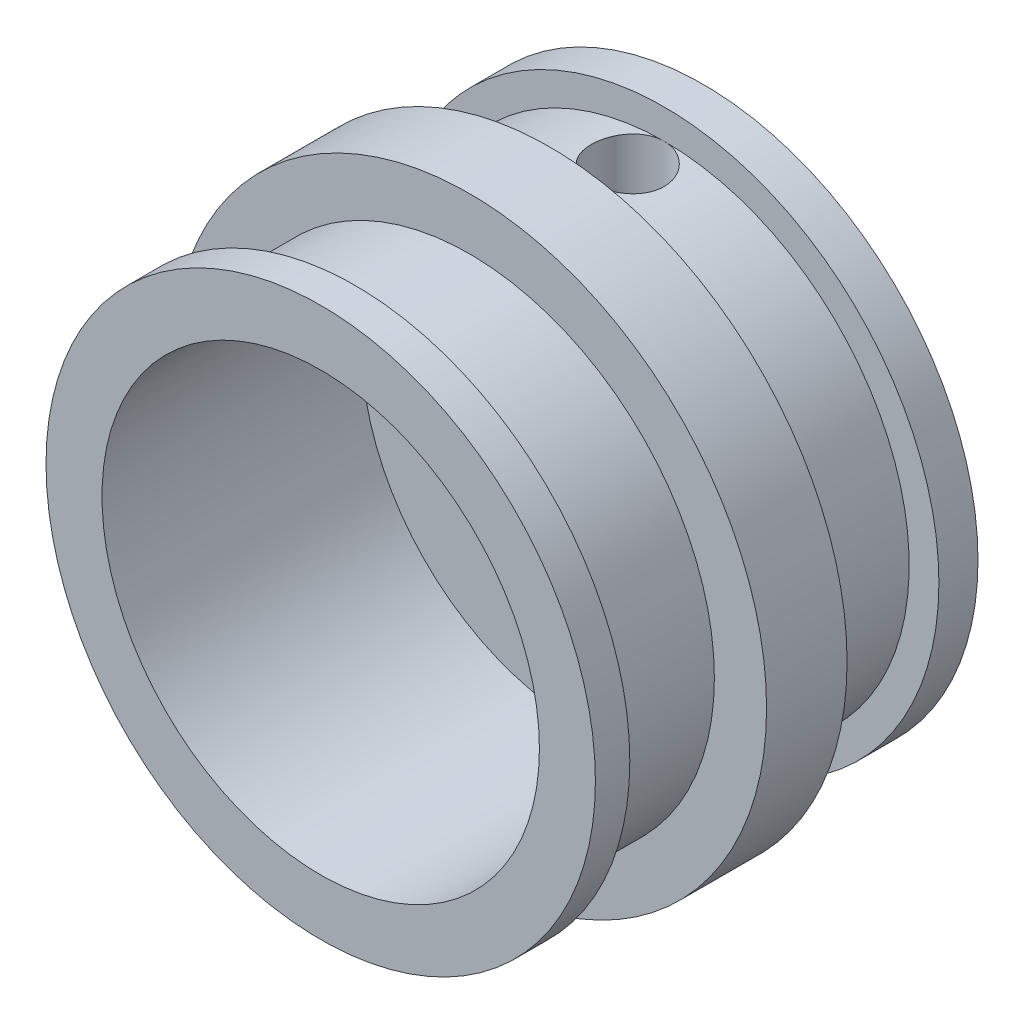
ISO-10303-21;
HEADER;
FILE_DESCRIPTION(('STEP AP214'),'2;1');
FILE_NAME('part.step','',(''),(''),'','','');
FILE_SCHEMA(('AUTOMOTIVE_DESIGN { 1 0 10303 214 1 1 1 1 }'));
ENDSEC;
DATA;
#1=APPLICATION_CONTEXT('core data for automotive mechanical design processes');
#2=APPLICATION_PROTOCOL_DEFINITION('international standard','automotive_design',2000,#1);
#3=PRODUCT_CONTEXT('',#1,'mechanical');
#4=PRODUCT('Part','Part','',(#3));
#5=PRODUCT_RELATED_PRODUCT_CATEGORY('part','',(#4));
#6=PRODUCT_DEFINITION_FORMATION('','',#4);
#7=PRODUCT_DEFINITION_CONTEXT('part definition',#1,'design');
#8=PRODUCT_DEFINITION('design','',#6,#7);
#9=PRODUCT_DEFINITION_SHAPE('','',#8);
#10=(LENGTH_UNIT() NAMED_UNIT(*) SI_UNIT(.MILLI.,.METRE.));
#11=(NAMED_UNIT(*) PLANE_ANGLE_UNIT() SI_UNIT($,.RADIAN.));
#12=(NAMED_UNIT(*) SI_UNIT($,.STERADIAN.) SOLID_ANGLE_UNIT());
#13=UNCERTAINTY_MEASURE_WITH_UNIT(LENGTH_MEASURE(1.E-05),#10,'distance_accuracy_value','');
#14=(GEOMETRIC_REPRESENTATION_CONTEXT(3) GLOBAL_UNCERTAINTY_ASSIGNED_CONTEXT((#13)) GLOBAL_UNIT_ASSIGNED_CONTEXT((#10,
#11,#12)) REPRESENTATION_CONTEXT('',''));
#15=CARTESIAN_POINT('',(0.,0.,0.));
#16=DIRECTION('',(0.,0.,1.));
#17=DIRECTION('',(1.,0.,0.));
#18=AXIS2_PLACEMENT_3D('',#15,#16,#17);
#19=CARTESIAN_POINT('',(0.,0.,1.34));
#20=DIRECTION('',(0.,0.,-1.));
#21=DIRECTION('',(-1.,0.,0.));
#22=AXIS2_PLACEMENT_3D('',#19,#20,#21);
#23=CYLINDRICAL_SURFACE('',#22,9.42);
#24=CARTESIAN_POINT('',(0.,0.,1.34));
#25=DIRECTION('',(0.,0.,1.));
#26=DIRECTION('',(1.,0.,0.));
#27=AXIS2_PLACEMENT_3D('',#24,#25,#26);
#28=CIRCLE('',#27,9.42);
#29=CARTESIAN_POINT('',(9.42,0.,1.34));
#30=VERTEX_POINT('',#29);
#31=EDGE_CURVE('E11',#30,#30,#28,.T.);
#32=ORIENTED_EDGE('',*,*,#31,.F.);
#33=EDGE_LOOP('',(#32));
#34=FACE_BOUND('',#33,.T.);
#35=CARTESIAN_POINT('',(0.,0.,0.));
#36=DIRECTION('',(0.,0.,1.));
#37=DIRECTION('',(1.,0.,0.));
#38=AXIS2_PLACEMENT_3D('',#35,#36,#37);
#39=CIRCLE('',#38,9.42);
#40=CARTESIAN_POINT('',(9.42,0.,0.));
#41=VERTEX_POINT('',#40);
#42=EDGE_CURVE('E47',#41,#41,#39,.T.);
#43=ORIENTED_EDGE('',*,*,#42,.T.);
#44=EDGE_LOOP('',(#43));
#45=FACE_BOUND('',#44,.T.);
#46=ADVANCED_FACE('F35',(#34,#45),#23,.T.);
#47=CARTESIAN_POINT('',(0.,0.,1.34));
#48=DIRECTION('',(0.,0.,1.));
#49=DIRECTION('',(1.,0.,0.));
#50=AXIS2_PLACEMENT_3D('',#47,#48,#49);
#51=PLANE('',#50);
#52=CARTESIAN_POINT('',(0.,0.,1.34));
#53=DIRECTION('',(0.,0.,1.));
#54=DIRECTION('',(1.,0.,0.));
#55=AXIS2_PLACEMENT_3D('',#52,#53,#54);
#56=CIRCLE('',#55,8.4);
#57=CARTESIAN_POINT('',(0.,-8.4,1.34));
#58=VERTEX_POINT('',#57);
#59=CARTESIAN_POINT('',(0.,8.4,1.34));
#60=VERTEX_POINT('',#59);
#61=EDGE_CURVE('E98',#58,#60,#56,.T.);
#62=ORIENTED_EDGE('',*,*,#61,.F.);
#63=EDGE_CURVE('E96',#60,#58,#56,.T.);
#64=ORIENTED_EDGE('',*,*,#63,.F.);
#65=EDGE_LOOP('',(#62,#64));
#66=FACE_BOUND('',#65,.T.);
#67=ORIENTED_EDGE('',*,*,#31,.T.);
#68=EDGE_LOOP('',(#67));
#69=FACE_BOUND('',#68,.T.);
#70=ADVANCED_FACE('F154',(#66,#69),#51,.T.);
#71=CARTESIAN_POINT('',(0.,0.,0.));
#72=DIRECTION('',(0.,0.,1.));
#73=DIRECTION('',(1.,0.,0.));
#74=AXIS2_PLACEMENT_3D('',#71,#72,#73);
#75=PLANE('',#74);
#76=CARTESIAN_POINT('',(0.,0.,0.));
#77=DIRECTION('',(0.,0.,-1.));
#78=DIRECTION('',(-1.,0.,0.));
#79=AXIS2_PLACEMENT_3D('',#76,#77,#78);
#80=CIRCLE('',#79,1.5);
#81=CARTESIAN_POINT('',(-1.5,0.,0.));
#82=VERTEX_POINT('',#81);
#83=EDGE_CURVE('E65',#82,#82,#80,.T.);
#84=ORIENTED_EDGE('',*,*,#83,.F.);
#85=EDGE_LOOP('',(#84));
#86=FACE_BOUND('',#85,.T.);
#87=ORIENTED_EDGE('',*,*,#42,.F.);
#88=EDGE_LOOP('',(#87));
#89=FACE_BOUND('',#88,.T.);
#90=ADVANCED_FACE('F159',(#86,#89),#75,.F.);
#91=CARTESIAN_POINT('',(0.,0.,5.26));
#92=DIRECTION('',(0.,0.,-1.));
#93=DIRECTION('',(-1.,0.,0.));
#94=AXIS2_PLACEMENT_3D('',#91,#92,#93);
#95=CYLINDRICAL_SURFACE('',#94,8.4);
#96=CARTESIAN_POINT('',(0.,0.,5.26));
#97=DIRECTION('',(0.,0.,1.));
#98=DIRECTION('',(1.,0.,0.));
#99=AXIS2_PLACEMENT_3D('',#96,#97,#98);
#100=CIRCLE('',#99,8.4);
#101=CARTESIAN_POINT('',(8.4,0.,5.26));
#102=VERTEX_POINT('',#101);
#103=EDGE_CURVE('E94',#102,#102,#100,.T.);
#104=ORIENTED_EDGE('',*,*,#103,.F.);
#105=EDGE_LOOP('',(#104));
#106=FACE_BOUND('',#105,.T.);
#107=ORIENTED_EDGE('',*,*,#61,.T.);
#108=CARTESIAN_POINT('',(0.,8.4,1.34));
#109=CARTESIAN_POINT('',(0.0697995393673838,8.39999888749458,1.34000288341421));
#110=CARTESIAN_POINT('',(0.139639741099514,8.39912088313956,1.34586610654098));
#111=CARTESIAN_POINT('',(0.277368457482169,8.39570284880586,1.36915840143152));
#112=CARTESIAN_POINT('',(0.345254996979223,8.39316119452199,1.38659877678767));
#113=CARTESIAN_POINT('',(0.477063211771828,8.3867015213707,1.43251309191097));
#114=CARTESIAN_POINT('',(0.540987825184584,8.38278453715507,1.46097873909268));
#115=CARTESIAN_POINT('',(0.66314319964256,8.37400717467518,1.52811540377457));
#116=CARTESIAN_POINT('',(0.721374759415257,8.36914692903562,1.56678498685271));
#117=CARTESIAN_POINT('',(0.830948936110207,8.3589818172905,1.65354887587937));
#118=CARTESIAN_POINT('',(0.882241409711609,8.35367412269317,1.70170618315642));
#119=CARTESIAN_POINT('',(0.9760488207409,8.34323449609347,1.80594295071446));
#120=CARTESIAN_POINT('',(1.01856325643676,8.33810257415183,1.8620228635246));
#121=CARTESIAN_POINT('',(1.09380254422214,8.32856808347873,1.98084930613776));
#122=CARTESIAN_POINT('',(1.12647895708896,8.32416916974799,2.04362682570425));
#123=CARTESIAN_POINT('',(1.18080509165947,8.31663731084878,2.17385547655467));
#124=CARTESIAN_POINT('',(1.20245540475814,8.31350429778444,2.24130635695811));
#125=CARTESIAN_POINT('',(1.23395920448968,8.30888674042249,2.37844001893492));
#126=CARTESIAN_POINT('',(1.24389848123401,8.30739021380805,2.44810268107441));
#127=CARTESIAN_POINT('',(1.25196382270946,8.30617867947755,2.58812193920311));
#128=CARTESIAN_POINT('',(1.2500905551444,8.30646357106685,2.65847849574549));
#129=CARTESIAN_POINT('',(1.23465410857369,8.30877172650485,2.79728276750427));
#130=CARTESIAN_POINT('',(1.22118642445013,8.31078078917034,2.86574137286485));
#131=CARTESIAN_POINT('',(1.18309290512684,8.31628873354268,2.9994162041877));
#132=CARTESIAN_POINT('',(1.15846675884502,8.31978765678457,3.06463233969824));
#133=CARTESIAN_POINT('',(1.0986558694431,8.3278967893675,3.19026184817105));
#134=CARTESIAN_POINT('',(1.06343062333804,8.33251124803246,3.25065565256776));
#135=CARTESIAN_POINT('',(0.983450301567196,8.34232843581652,3.36471136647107));
#136=CARTESIAN_POINT('',(0.938694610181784,8.34753120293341,3.41837284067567));
#137=CARTESIAN_POINT('',(0.840399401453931,8.35800155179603,3.51799413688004));
#138=CARTESIAN_POINT('',(0.786777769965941,8.3632692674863,3.56387296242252));
#139=CARTESIAN_POINT('',(0.672552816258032,8.37322840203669,3.64599260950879));
#140=CARTESIAN_POINT('',(0.61194946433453,8.37791981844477,3.68223339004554));
#141=CARTESIAN_POINT('',(0.485411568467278,8.3862025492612,3.74405215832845));
#142=CARTESIAN_POINT('',(0.419473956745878,8.38979322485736,3.76962395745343));
#143=CARTESIAN_POINT('',(0.284174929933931,8.39546454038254,3.80930877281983));
#144=CARTESIAN_POINT('',(0.214813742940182,8.39754528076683,3.8234225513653));
#145=CARTESIAN_POINT('',(0.0753355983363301,8.39994899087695,3.83968312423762));
#146=CARTESIAN_POINT('',(0.00523189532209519,8.40028831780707,3.84194128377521));
#147=CARTESIAN_POINT('',(-0.134353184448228,8.39921547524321,3.83472202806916));
#148=CARTESIAN_POINT('',(-0.203834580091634,8.39780335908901,3.82524497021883));
#149=CARTESIAN_POINT('',(-0.339865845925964,8.39339641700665,3.79491689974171));
#150=CARTESIAN_POINT('',(-0.40642806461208,8.39040913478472,3.77412008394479));
#151=CARTESIAN_POINT('',(-0.535120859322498,8.38318575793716,3.72179995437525));
#152=CARTESIAN_POINT('',(-0.597251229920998,8.37894960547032,3.69027614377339));
#153=CARTESIAN_POINT('',(-0.715806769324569,8.36965866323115,3.61713517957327));
#154=CARTESIAN_POINT('',(-0.77218786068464,8.36459822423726,3.5754473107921));
#155=CARTESIAN_POINT('',(-0.877193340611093,8.35423970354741,3.48326013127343));
#156=CARTESIAN_POINT('',(-0.92581728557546,8.34894160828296,3.43276031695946));
#157=CARTESIAN_POINT('',(-1.01433291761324,8.33865310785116,3.32388723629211));
#158=CARTESIAN_POINT('',(-1.05414999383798,8.33366557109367,3.26545299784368));
#159=CARTESIAN_POINT('',(-1.12340317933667,8.32461351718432,3.14266026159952));
#160=CARTESIAN_POINT('',(-1.15283956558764,8.3205489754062,3.07830192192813));
#161=CARTESIAN_POINT('',(-1.20037987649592,8.31382381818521,2.94571130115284));
#162=CARTESIAN_POINT('',(-1.21852320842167,8.31115832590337,2.8774934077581));
#163=CARTESIAN_POINT('',(-1.24308789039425,8.30752004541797,2.7389361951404));
#164=CARTESIAN_POINT('',(-1.24951003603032,8.30654714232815,2.66859702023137));
#165=CARTESIAN_POINT('',(-1.25043134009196,8.30640843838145,2.52853750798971));
#166=CARTESIAN_POINT('',(-1.24504780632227,8.30722485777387,2.45881793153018));
#167=CARTESIAN_POINT('',(-1.22276180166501,8.31053418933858,2.3212874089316));
#168=CARTESIAN_POINT('',(-1.20585934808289,8.3130270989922,2.25347645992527));
#169=CARTESIAN_POINT('',(-1.16105654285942,8.31940234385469,2.12171973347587));
#170=CARTESIAN_POINT('',(-1.13316426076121,8.3232836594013,2.05777115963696));
#171=CARTESIAN_POINT('',(-1.06718521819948,8.33199965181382,1.93544235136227));
#172=CARTESIAN_POINT('',(-1.02909812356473,8.33683435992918,1.87706229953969));
#173=CARTESIAN_POINT('',(-0.943383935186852,8.34696960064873,1.76693152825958));
#174=CARTESIAN_POINT('',(-0.895669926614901,8.35227411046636,1.71524881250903));
#175=CARTESIAN_POINT('',(-0.79223997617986,8.36271796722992,1.62058195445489));
#176=CARTESIAN_POINT('',(-0.736522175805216,8.36785727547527,1.57759983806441));
#177=CARTESIAN_POINT('',(-0.618311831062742,8.37742339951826,1.50134686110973));
#178=CARTESIAN_POINT('',(-0.555784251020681,8.38184620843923,1.46812982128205));
#179=CARTESIAN_POINT('',(-0.426001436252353,8.38944166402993,1.41271883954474));
#180=CARTESIAN_POINT('',(-0.358751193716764,8.39261560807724,1.39051345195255));
#181=CARTESIAN_POINT('',(-0.24266404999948,8.3966291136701,1.36280803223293));
#182=CARTESIAN_POINT('',(-0.194544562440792,8.3978867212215,1.3542680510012));
#183=CARTESIAN_POINT('',(-0.0976233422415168,8.39957254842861,1.34286306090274));
#184=CARTESIAN_POINT('',(-0.0488216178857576,8.40000077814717,1.3399979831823));
#185=CARTESIAN_POINT('',(0.,8.4,1.34));
#186=B_SPLINE_CURVE_WITH_KNOTS('',3,(#108,#109,#110,#111,#112,#113,#114,#115,#116,#117,#118,
#119,#120,#121,#122,#123,#124,#125,#126,#127,#128,#129,#130,#131,#132,#133,#134,#135,#136,#137,
#138,#139,#140,#141,#142,#143,#144,#145,#146,#147,#148,#149,#150,#151,#152,#153,#154,#155,#156,
#157,#158,#159,#160,#161,#162,#163,#164,#165,#166,#167,#168,#169,#170,#171,#172,#173,#174,#175,
#176,#177,#178,#179,#180,#181,#182,#183,#184,#185),.UNSPECIFIED.,.T.,.F.,(4,2,2,2,2,2,2,2,2,2,2,
2,2,2,2,2,2,2,2,2,2,2,2,2,2,2,2,2,2,2,2,2,2,2,2,2,2,2,4),(0.,0.209220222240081,
0.418645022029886,0.627912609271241,0.837150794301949,1.04782829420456,1.25851783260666,
1.47022838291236,1.68192757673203,1.89206611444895,2.10219277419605,2.3106051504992,
2.51902333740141,2.72824830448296,2.93748679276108,3.14878457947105,3.36008326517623,
3.57150434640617,3.78291136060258,3.99232893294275,4.20174012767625,4.41015740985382,
4.61858434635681,4.82850498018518,5.03843761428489,5.25008589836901,5.46172853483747,
5.67262843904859,5.88351402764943,6.09231364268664,6.30111294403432,6.509759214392,
6.71841232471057,6.92904106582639,7.13971879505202,7.3515368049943,7.56313418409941,
7.7094760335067,7.85581610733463),.UNSPECIFIED.);
#187=EDGE_CURVE('E57',#60,#60,#186,.T.);
#188=ORIENTED_EDGE('',*,*,#187,.T.);
#189=ORIENTED_EDGE('',*,*,#63,.T.);
#190=CARTESIAN_POINT('',(0.,-8.4,1.34));
#191=CARTESIAN_POINT('',(-0.0697995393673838,-8.39999888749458,1.34000288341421));
#192=CARTESIAN_POINT('',(-0.139639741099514,-8.39912088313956,1.34586610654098));
#193=CARTESIAN_POINT('',(-0.277368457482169,-8.39570284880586,1.36915840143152));
#194=CARTESIAN_POINT('',(-0.345254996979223,-8.39316119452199,1.38659877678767));
#195=CARTESIAN_POINT('',(-0.477063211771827,-8.3867015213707,1.43251309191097));
#196=CARTESIAN_POINT('',(-0.540987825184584,-8.38278453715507,1.46097873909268));
#197=CARTESIAN_POINT('',(-0.66314319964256,-8.37400717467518,1.52811540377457));
#198=CARTESIAN_POINT('',(-0.721374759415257,-8.36914692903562,1.56678498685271));
#199=CARTESIAN_POINT('',(-0.830948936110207,-8.3589818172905,1.65354887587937));
#200=CARTESIAN_POINT('',(-0.882241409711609,-8.35367412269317,1.70170618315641));
#201=CARTESIAN_POINT('',(-0.976048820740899,-8.34323449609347,1.80594295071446));
#202=CARTESIAN_POINT('',(-1.01856325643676,-8.33810257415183,1.8620228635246));
#203=CARTESIAN_POINT('',(-1.09380254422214,-8.32856808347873,1.98084930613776));
#204=CARTESIAN_POINT('',(-1.12647895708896,-8.32416916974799,2.04362682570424));
#205=CARTESIAN_POINT('',(-1.18080509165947,-8.31663731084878,2.17385547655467));
#206=CARTESIAN_POINT('',(-1.20245540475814,-8.31350429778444,2.2413063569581));
#207=CARTESIAN_POINT('',(-1.23395920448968,-8.30888674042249,2.37844001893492));
#208=CARTESIAN_POINT('',(-1.24389848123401,-8.30739021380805,2.44810268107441));
#209=CARTESIAN_POINT('',(-1.25196382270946,-8.30617867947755,2.5881219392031));
#210=CARTESIAN_POINT('',(-1.2500905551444,-8.30646357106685,2.65847849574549));
#211=CARTESIAN_POINT('',(-1.23465410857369,-8.30877172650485,2.79728276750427));
#212=CARTESIAN_POINT('',(-1.22118642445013,-8.31078078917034,2.86574137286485));
#213=CARTESIAN_POINT('',(-1.18309290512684,-8.31628873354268,2.9994162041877));
#214=CARTESIAN_POINT('',(-1.15846675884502,-8.31978765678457,3.06463233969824));
#215=CARTESIAN_POINT('',(-1.0986558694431,-8.3278967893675,3.19026184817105));
#216=CARTESIAN_POINT('',(-1.06343062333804,-8.33251124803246,3.25065565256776));
#217=CARTESIAN_POINT('',(-0.983450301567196,-8.34232843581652,3.36471136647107));
#218=CARTESIAN_POINT('',(-0.938694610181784,-8.34753120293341,3.41837284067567));
#219=CARTESIAN_POINT('',(-0.84039940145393,-8.35800155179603,3.51799413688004));
#220=CARTESIAN_POINT('',(-0.78677776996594,-8.3632692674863,3.56387296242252));
#221=CARTESIAN_POINT('',(-0.672552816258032,-8.37322840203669,3.64599260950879));
#222=CARTESIAN_POINT('',(-0.61194946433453,-8.37791981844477,3.68223339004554));
#223=CARTESIAN_POINT('',(-0.485411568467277,-8.3862025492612,3.74405215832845));
#224=CARTESIAN_POINT('',(-0.419473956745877,-8.38979322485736,3.76962395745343));
#225=CARTESIAN_POINT('',(-0.28417492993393,-8.39546454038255,3.80930877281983));
#226=CARTESIAN_POINT('',(-0.214813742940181,-8.39754528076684,3.8234225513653));
#227=CARTESIAN_POINT('',(-0.0753355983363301,-8.39994899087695,3.83968312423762));
#228=CARTESIAN_POINT('',(-0.00523189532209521,-8.40028831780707,3.84194128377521));
#229=CARTESIAN_POINT('',(0.134353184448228,-8.39921547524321,3.83472202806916));
#230=CARTESIAN_POINT('',(0.203834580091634,-8.39780335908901,3.82524497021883));
#231=CARTESIAN_POINT('',(0.339865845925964,-8.39339641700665,3.79491689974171));
#232=CARTESIAN_POINT('',(0.40642806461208,-8.39040913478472,3.77412008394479));
#233=CARTESIAN_POINT('',(0.535120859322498,-8.38318575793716,3.72179995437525));
#234=CARTESIAN_POINT('',(0.597251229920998,-8.37894960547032,3.69027614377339));
#235=CARTESIAN_POINT('',(0.715806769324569,-8.36965866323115,3.61713517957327));
#236=CARTESIAN_POINT('',(0.772187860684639,-8.36459822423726,3.5754473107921));
#237=CARTESIAN_POINT('',(0.877193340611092,-8.35423970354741,3.48326013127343));
#238=CARTESIAN_POINT('',(0.92581728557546,-8.34894160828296,3.43276031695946));
#239=CARTESIAN_POINT('',(1.01433291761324,-8.33865310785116,3.32388723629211));
#240=CARTESIAN_POINT('',(1.05414999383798,-8.33366557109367,3.26545299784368));
#241=CARTESIAN_POINT('',(1.12340317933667,-8.32461351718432,3.14266026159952));
#242=CARTESIAN_POINT('',(1.15283956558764,-8.3205489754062,3.07830192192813));
#243=CARTESIAN_POINT('',(1.20037987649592,-8.31382381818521,2.94571130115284));
#244=CARTESIAN_POINT('',(1.21852320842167,-8.31115832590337,2.8774934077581));
#245=CARTESIAN_POINT('',(1.24308789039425,-8.30752004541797,2.7389361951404));
#246=CARTESIAN_POINT('',(1.24951003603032,-8.30654714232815,2.66859702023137));
#247=CARTESIAN_POINT('',(1.25043134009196,-8.30640843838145,2.52853750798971));
#248=CARTESIAN_POINT('',(1.24504780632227,-8.30722485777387,2.45881793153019));
#249=CARTESIAN_POINT('',(1.22276180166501,-8.31053418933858,2.3212874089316));
#250=CARTESIAN_POINT('',(1.20585934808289,-8.3130270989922,2.25347645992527));
#251=CARTESIAN_POINT('',(1.16105654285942,-8.31940234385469,2.12171973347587));
#252=CARTESIAN_POINT('',(1.13316426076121,-8.3232836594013,2.05777115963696));
#253=CARTESIAN_POINT('',(1.06718521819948,-8.33199965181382,1.93544235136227));
#254=CARTESIAN_POINT('',(1.02909812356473,-8.33683435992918,1.87706229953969));
#255=CARTESIAN_POINT('',(0.943383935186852,-8.34696960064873,1.76693152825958));
#256=CARTESIAN_POINT('',(0.895669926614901,-8.35227411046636,1.71524881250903));
#257=CARTESIAN_POINT('',(0.79223997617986,-8.36271796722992,1.62058195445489));
#258=CARTESIAN_POINT('',(0.736522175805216,-8.36785727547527,1.57759983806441));
#259=CARTESIAN_POINT('',(0.618311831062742,-8.37742339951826,1.50134686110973));
#260=CARTESIAN_POINT('',(0.555784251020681,-8.38184620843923,1.46812982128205));
#261=CARTESIAN_POINT('',(0.426001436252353,-8.38944166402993,1.41271883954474));
#262=CARTESIAN_POINT('',(0.358751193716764,-8.39261560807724,1.39051345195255));
#263=CARTESIAN_POINT('',(0.24266404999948,-8.3966291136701,1.36280803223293));
#264=CARTESIAN_POINT('',(0.194544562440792,-8.3978867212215,1.3542680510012));
#265=CARTESIAN_POINT('',(0.0976233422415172,-8.39957254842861,1.34286306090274));
#266=CARTESIAN_POINT('',(0.0488216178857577,-8.40000077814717,1.3399979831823));
#267=CARTESIAN_POINT('',(0.,-8.4,1.34));
#268=B_SPLINE_CURVE_WITH_KNOTS('',3,(#190,#191,#192,#193,#194,#195,#196,#197,#198,#199,#200,
#201,#202,#203,#204,#205,#206,#207,#208,#209,#210,#211,#212,#213,#214,#215,#216,#217,#218,#219,
#220,#221,#222,#223,#224,#225,#226,#227,#228,#229,#230,#231,#232,#233,#234,#235,#236,#237,#238,
#239,#240,#241,#242,#243,#244,#245,#246,#247,#248,#249,#250,#251,#252,#253,#254,#255,#256,#257,
#258,#259,#260,#261,#262,#263,#264,#265,#266,#267),.UNSPECIFIED.,.T.,.F.,(4,2,2,2,2,2,2,2,2,2,2,
2,2,2,2,2,2,2,2,2,2,2,2,2,2,2,2,2,2,2,2,2,2,2,2,2,2,2,4),(0.,0.209220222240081,
0.418645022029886,0.627912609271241,0.837150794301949,1.04782829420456,1.25851783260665,
1.47022838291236,1.68192757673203,1.89206611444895,2.10219277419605,2.3106051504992,
2.51902333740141,2.72824830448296,2.93748679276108,3.14878457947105,3.36008326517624,
3.57150434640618,3.78291136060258,3.99232893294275,4.20174012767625,4.41015740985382,
4.61858434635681,4.82850498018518,5.03843761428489,5.25008589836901,5.46172853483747,
5.67262843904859,5.88351402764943,6.09231364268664,6.30111294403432,6.509759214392,
6.71841232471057,6.92904106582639,7.13971879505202,7.3515368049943,7.56313418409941,
7.7094760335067,7.85581610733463),.UNSPECIFIED.);
#269=EDGE_CURVE('E53',#58,#58,#268,.T.);
#270=ORIENTED_EDGE('',*,*,#269,.T.);
#271=EDGE_LOOP('',(#107,#188,#189,#270));
#272=FACE_BOUND('',#271,.T.);
#273=ADVANCED_FACE('F74',(#106,#272),#95,.T.);
#274=CARTESIAN_POINT('',(0.,0.,8.02));
#275=DIRECTION('',(0.,0.,-1.));
#276=DIRECTION('',(-1.,0.,0.));
#277=AXIS2_PLACEMENT_3D('',#274,#275,#276);
#278=CYLINDRICAL_SURFACE('',#277,10.19);
#279=CARTESIAN_POINT('',(0.,0.,8.02));
#280=DIRECTION('',(0.,0.,1.));
#281=DIRECTION('',(1.,0.,0.));
#282=AXIS2_PLACEMENT_3D('',#279,#280,#281);
#283=CIRCLE('',#282,10.19);
#284=CARTESIAN_POINT('',(10.19,0.,8.02));
#285=VERTEX_POINT('',#284);
#286=EDGE_CURVE('E104',#285,#285,#283,.T.);
#287=ORIENTED_EDGE('',*,*,#286,.F.);
#288=EDGE_LOOP('',(#287));
#289=FACE_BOUND('',#288,.T.);
#290=CARTESIAN_POINT('',(0.,0.,5.26));
#291=DIRECTION('',(0.,0.,1.));
#292=DIRECTION('',(1.,0.,0.));
#293=AXIS2_PLACEMENT_3D('',#290,#291,#292);
#294=CIRCLE('',#293,10.19);
#295=CARTESIAN_POINT('',(10.19,0.,5.26));
#296=VERTEX_POINT('',#295);
#297=EDGE_CURVE('E101',#296,#296,#294,.T.);
#298=ORIENTED_EDGE('',*,*,#297,.T.);
#299=EDGE_LOOP('',(#298));
#300=FACE_BOUND('',#299,.T.);
#301=ADVANCED_FACE('F170',(#289,#300),#278,.T.);
#302=CARTESIAN_POINT('',(0.,0.,8.02));
#303=DIRECTION('',(0.,0.,1.));
#304=DIRECTION('',(1.,0.,0.));
#305=AXIS2_PLACEMENT_3D('',#302,#303,#304);
#306=PLANE('',#305);
#307=CARTESIAN_POINT('',(0.,0.,8.02));
#308=DIRECTION('',(0.,0.,1.));
#309=DIRECTION('',(1.,0.,0.));
#310=AXIS2_PLACEMENT_3D('',#307,#308,#309);
#311=CIRCLE('',#310,8.4);
#312=CARTESIAN_POINT('',(8.4,0.,8.02));
#313=VERTEX_POINT('',#312);
#314=EDGE_CURVE('E108',#313,#313,#311,.T.);
#315=ORIENTED_EDGE('',*,*,#314,.F.);
#316=EDGE_LOOP('',(#315));
#317=FACE_BOUND('',#316,.T.);
#318=ORIENTED_EDGE('',*,*,#286,.T.);
#319=EDGE_LOOP('',(#318));
#320=FACE_BOUND('',#319,.T.);
#321=ADVANCED_FACE('F266',(#317,#320),#306,.T.);
#322=CARTESIAN_POINT('',(0.,0.,5.26));
#323=DIRECTION('',(0.,0.,1.));
#324=DIRECTION('',(1.,0.,0.));
#325=AXIS2_PLACEMENT_3D('',#322,#323,#324);
#326=PLANE('',#325);
#327=ORIENTED_EDGE('',*,*,#103,.T.);
#328=EDGE_LOOP('',(#327));
#329=FACE_BOUND('',#328,.T.);
#330=ORIENTED_EDGE('',*,*,#297,.F.);
#331=EDGE_LOOP('',(#330));
#332=FACE_BOUND('',#331,.T.);
#333=ADVANCED_FACE('F258',(#329,#332),#326,.F.);
#334=CARTESIAN_POINT('',(0.,0.,11.94));
#335=DIRECTION('',(0.,0.,-1.));
#336=DIRECTION('',(-1.,0.,0.));
#337=AXIS2_PLACEMENT_3D('',#334,#335,#336);
#338=CYLINDRICAL_SURFACE('',#337,8.4);
#339=CARTESIAN_POINT('',(0.,0.,11.94));
#340=DIRECTION('',(0.,0.,1.));
#341=DIRECTION('',(1.,0.,0.));
#342=AXIS2_PLACEMENT_3D('',#339,#340,#341);
#343=CIRCLE('',#342,8.4);
#344=CARTESIAN_POINT('',(8.4,0.,11.94));
#345=VERTEX_POINT('',#344);
#346=EDGE_CURVE('E105',#345,#345,#343,.T.);
#347=ORIENTED_EDGE('',*,*,#346,.F.);
#348=EDGE_LOOP('',(#347));
#349=FACE_BOUND('',#348,.T.);
#350=ORIENTED_EDGE('',*,*,#314,.T.);
#351=EDGE_LOOP('',(#350));
#352=FACE_BOUND('',#351,.T.);
#353=ADVANCED_FACE('F144',(#349,#352),#338,.T.);
#354=CARTESIAN_POINT('',(0.,0.,13.12));
#355=DIRECTION('',(0.,0.,-1.));
#356=DIRECTION('',(-1.,0.,0.));
#357=AXIS2_PLACEMENT_3D('',#354,#355,#356);
#358=CYLINDRICAL_SURFACE('',#357,9.42);
#359=CARTESIAN_POINT('',(0.,0.,13.12));
#360=DIRECTION('',(0.,0.,1.));
#361=DIRECTION('',(1.,0.,0.));
#362=AXIS2_PLACEMENT_3D('',#359,#360,#361);
#363=CIRCLE('',#362,9.42);
#364=CARTESIAN_POINT('',(9.42,0.,13.12));
#365=VERTEX_POINT('',#364);
#366=EDGE_CURVE('E111',#365,#365,#363,.T.);
#367=ORIENTED_EDGE('',*,*,#366,.F.);
#368=EDGE_LOOP('',(#367));
#369=FACE_BOUND('',#368,.T.);
#370=CARTESIAN_POINT('',(0.,0.,11.94));
#371=DIRECTION('',(0.,0.,1.));
#372=DIRECTION('',(1.,0.,0.));
#373=AXIS2_PLACEMENT_3D('',#370,#371,#372);
#374=CIRCLE('',#373,9.42);
#375=CARTESIAN_POINT('',(9.42,0.,11.94));
#376=VERTEX_POINT('',#375);
#377=EDGE_CURVE('E114',#376,#376,#374,.T.);
#378=ORIENTED_EDGE('',*,*,#377,.T.);
#379=EDGE_LOOP('',(#378));
#380=FACE_BOUND('',#379,.T.);
#381=ADVANCED_FACE('F138',(#369,#380),#358,.T.);
#382=CARTESIAN_POINT('',(0.,0.,13.12));
#383=DIRECTION('',(0.,0.,1.));
#384=DIRECTION('',(1.,0.,0.));
#385=AXIS2_PLACEMENT_3D('',#382,#383,#384);
#386=PLANE('',#385);
#387=CARTESIAN_POINT('',(0.,0.,13.12));
#388=DIRECTION('',(0.,0.,1.));
#389=DIRECTION('',(1.,0.,0.));
#390=AXIS2_PLACEMENT_3D('',#387,#388,#389);
#391=CIRCLE('',#390,7.5);
#392=CARTESIAN_POINT('',(7.5,0.,13.12));
#393=VERTEX_POINT('',#392);
#394=EDGE_CURVE('E120',#393,#393,#391,.T.);
#395=ORIENTED_EDGE('',*,*,#394,.F.);
#396=EDGE_LOOP('',(#395));
#397=FACE_BOUND('',#396,.T.);
#398=ORIENTED_EDGE('',*,*,#366,.T.);
#399=EDGE_LOOP('',(#398));
#400=FACE_BOUND('',#399,.T.);
#401=ADVANCED_FACE('F135',(#397,#400),#386,.T.);
#402=CARTESIAN_POINT('',(0.,0.,11.94));
#403=DIRECTION('',(0.,0.,1.));
#404=DIRECTION('',(1.,0.,0.));
#405=AXIS2_PLACEMENT_3D('',#402,#403,#404);
#406=PLANE('',#405);
#407=ORIENTED_EDGE('',*,*,#346,.T.);
#408=EDGE_LOOP('',(#407));
#409=FACE_BOUND('',#408,.T.);
#410=ORIENTED_EDGE('',*,*,#377,.F.);
#411=EDGE_LOOP('',(#410));
#412=FACE_BOUND('',#411,.T.);
#413=ADVANCED_FACE('F131',(#409,#412),#406,.F.);
#414=CARTESIAN_POINT('',(0.,0.,4.22));
#415=DIRECTION('',(0.,0.,1.));
#416=DIRECTION('',(1.,0.,0.));
#417=AXIS2_PLACEMENT_3D('',#414,#415,#416);
#418=CYLINDRICAL_SURFACE('',#417,7.5);
#419=CARTESIAN_POINT('',(0.,0.,4.22));
#420=DIRECTION('',(0.,0.,1.));
#421=DIRECTION('',(1.,0.,0.));
#422=AXIS2_PLACEMENT_3D('',#419,#420,#421);
#423=CIRCLE('',#422,7.5);
#424=CARTESIAN_POINT('',(7.5,0.,4.22));
#425=VERTEX_POINT('',#424);
#426=EDGE_CURVE('E117',#425,#425,#423,.T.);
#427=ORIENTED_EDGE('',*,*,#426,.F.);
#428=EDGE_LOOP('',(#427));
#429=FACE_BOUND('',#428,.T.);
#430=ORIENTED_EDGE('',*,*,#394,.T.);
#431=EDGE_LOOP('',(#430));
#432=FACE_BOUND('',#431,.T.);
#433=ADVANCED_FACE('F128',(#429,#432),#418,.F.);
#434=CARTESIAN_POINT('',(0.,0.,4.22));
#435=DIRECTION('',(0.,0.,1.));
#436=DIRECTION('',(1.,0.,0.));
#437=AXIS2_PLACEMENT_3D('',#434,#435,#436);
#438=PLANE('',#437);
#439=CARTESIAN_POINT('',(0.,0.,4.22));
#440=DIRECTION('',(0.,0.,1.));
#441=DIRECTION('',(1.,0.,0.));
#442=AXIS2_PLACEMENT_3D('',#439,#440,#441);
#443=CIRCLE('',#442,1.5);
#444=CARTESIAN_POINT('',(1.5,0.,4.22));
#445=VERTEX_POINT('',#444);
#446=EDGE_CURVE('E62',#445,#445,#443,.F.);
#447=ORIENTED_EDGE('',*,*,#446,.T.);
#448=EDGE_LOOP('',(#447));
#449=FACE_BOUND('',#448,.T.);
#450=ORIENTED_EDGE('',*,*,#426,.T.);
#451=EDGE_LOOP('',(#450));
#452=FACE_BOUND('',#451,.T.);
#453=ADVANCED_FACE('F126',(#449,#452),#438,.T.);
#454=CARTESIAN_POINT('',(0.,0.,13.121));
#455=DIRECTION('',(0.,0.,-1.));
#456=DIRECTION('',(-1.,0.,0.));
#457=AXIS2_PLACEMENT_3D('',#454,#455,#456);
#458=CYLINDRICAL_SURFACE('',#457,1.5);
#459=CARTESIAN_POINT('',(0.,-1.5,3.84));
#460=CARTESIAN_POINT('',(-0.0593787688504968,-1.49999760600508,3.83999755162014));
#461=CARTESIAN_POINT('',(-0.118775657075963,-1.49644333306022,3.83573873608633));
#462=CARTESIAN_POINT('',(-0.235591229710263,-1.48255383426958,3.81901865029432));
#463=CARTESIAN_POINT('',(-0.293008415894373,-1.47221358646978,3.80655130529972));
#464=CARTESIAN_POINT('',(-0.403915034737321,-1.44571337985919,3.77434389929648));
#465=CARTESIAN_POINT('',(-0.457425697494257,-1.42958821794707,3.75464730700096));
#466=CARTESIAN_POINT('',(-0.55992045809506,-1.39264614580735,3.70899163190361));
#467=CARTESIAN_POINT('',(-0.608903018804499,-1.37182765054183,3.68303043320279));
#468=CARTESIAN_POINT('',(-0.7189512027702,-1.31836960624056,3.61527232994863));
#469=CARTESIAN_POINT('',(-0.77784638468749,-1.28419684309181,3.57116142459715));
#470=CARTESIAN_POINT('',(-0.886006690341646,-1.21211904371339,3.47474132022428));
#471=CARTESIAN_POINT('',(-0.935244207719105,-1.17420376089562,3.42240936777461));
#472=CARTESIAN_POINT('',(-1.02476981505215,-1.0969954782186,3.30947566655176));
#473=CARTESIAN_POINT('',(-1.06487540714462,-1.05768996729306,3.2487387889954));
#474=CARTESIAN_POINT('',(-1.13460946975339,-0.98247337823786,3.11964932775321));
#475=CARTESIAN_POINT('',(-1.16426870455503,-0.946552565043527,3.05131989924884));
#476=CARTESIAN_POINT('',(-1.20096809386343,-0.898966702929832,2.93915232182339));
#477=CARTESIAN_POINT('',(-1.2121691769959,-0.883683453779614,2.89823415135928));
#478=CARTESIAN_POINT('',(-1.23050643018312,-0.857964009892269,2.81405890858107));
#479=CARTESIAN_POINT('',(-1.23765246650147,-0.847516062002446,2.7708077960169));
#480=CARTESIAN_POINT('',(-1.24740539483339,-0.833105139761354,2.68211619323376));
#481=CARTESIAN_POINT('',(-1.24995600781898,-0.829222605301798,2.63665546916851));
#482=CARTESIAN_POINT('',(-1.25004286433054,-0.829091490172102,2.54571924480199));
#483=CARTESIAN_POINT('',(-1.24757904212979,-0.832843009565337,2.50024374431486));
#484=CARTESIAN_POINT('',(-1.23752620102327,-0.847707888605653,2.40723645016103));
#485=CARTESIAN_POINT('',(-1.2295274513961,-0.859408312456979,2.3598487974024));
#486=CARTESIAN_POINT('',(-1.20871318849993,-0.888442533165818,2.2678988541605));
#487=CARTESIAN_POINT('',(-1.19588169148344,-0.905794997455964,2.22334651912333));
#488=CARTESIAN_POINT('',(-1.15722563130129,-0.955139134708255,2.11189560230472));
#489=CARTESIAN_POINT('',(-1.12819923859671,-0.989734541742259,2.04728511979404));
#490=CARTESIAN_POINT('',(-1.06071724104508,-1.0617636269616,1.92497126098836));
#491=CARTESIAN_POINT('',(-1.0222447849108,-1.09920229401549,1.86728050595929));
#492=CARTESIAN_POINT('',(-0.933838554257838,-1.17538495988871,1.75587958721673));
#493=CARTESIAN_POINT('',(-0.883411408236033,-1.21409510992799,1.70253430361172));
#494=CARTESIAN_POINT('',(-0.772419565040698,-1.28754911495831,1.6044403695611));
#495=CARTESIAN_POINT('',(-0.711877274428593,-1.32230145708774,1.55967317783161));
#496=CARTESIAN_POINT('',(-0.597056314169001,-1.37714389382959,1.4902931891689));
#497=CARTESIAN_POINT('',(-0.544863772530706,-1.39874156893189,1.46342871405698));
#498=CARTESIAN_POINT('',(-0.435535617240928,-1.43653920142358,1.4168284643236));
#499=CARTESIAN_POINT('',(-0.378403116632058,-1.45274252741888,1.39708824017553));
#500=CARTESIAN_POINT('',(-0.259977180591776,-1.47854912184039,1.36579141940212));
#501=CARTESIAN_POINT('',(-0.19865546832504,-1.4881013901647,1.35429803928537));
#502=CARTESIAN_POINT('',(-0.0742799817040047,-1.49945718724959,1.3406453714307));
#503=CARTESIAN_POINT('',(-0.0112273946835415,-1.50126590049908,1.3384798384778));
#504=CARTESIAN_POINT('',(0.106655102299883,-1.49722498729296,1.34333122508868));
#505=CARTESIAN_POINT('',(0.161565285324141,-1.49226673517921,1.34927932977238));
#506=CARTESIAN_POINT('',(0.269322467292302,-1.47662796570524,1.3681334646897));
#507=CARTESIAN_POINT('',(0.322169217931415,-1.46594676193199,1.38104032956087));
#508=CARTESIAN_POINT('',(0.425282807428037,-1.43944754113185,1.41331173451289));
#509=CARTESIAN_POINT('',(0.475505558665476,-1.42356257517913,1.43276053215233));
#510=CARTESIAN_POINT('',(0.571829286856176,-1.38768087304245,1.47719767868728));
#511=CARTESIAN_POINT('',(0.617928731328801,-1.36768261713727,1.5021880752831));
#512=CARTESIAN_POINT('',(0.725338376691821,-1.31487441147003,1.5692166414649));
#513=CARTESIAN_POINT('',(0.784177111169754,-1.28034513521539,1.61386964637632));
#514=CARTESIAN_POINT('',(0.892139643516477,-1.20761833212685,1.71141682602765));
#515=CARTESIAN_POINT('',(0.941232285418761,-1.16940960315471,1.76433649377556));
#516=CARTESIAN_POINT('',(1.03033901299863,-1.09176431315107,1.87848795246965));
#517=CARTESIAN_POINT('',(1.07017375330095,-1.05231803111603,1.93985223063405));
#518=CARTESIAN_POINT('',(1.13922410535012,-0.977105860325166,2.07029258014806));
#519=CARTESIAN_POINT('',(1.1684744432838,-0.941328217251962,2.13934244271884));
#520=CARTESIAN_POINT('',(1.20418713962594,-0.894635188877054,2.25214898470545));
#521=CARTESIAN_POINT('',(1.21494166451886,-0.879855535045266,2.29292093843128));
#522=CARTESIAN_POINT('',(1.23241118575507,-0.855213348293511,2.37672227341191));
#523=CARTESIAN_POINT('',(1.23913627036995,-0.845338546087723,2.41974572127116));
#524=CARTESIAN_POINT('',(1.24808646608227,-0.832077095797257,2.50781988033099));
#525=CARTESIAN_POINT('',(1.25025897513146,-0.828766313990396,2.55288820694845));
#526=CARTESIAN_POINT('',(1.2496910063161,-0.829621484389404,2.64292606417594));
#527=CARTESIAN_POINT('',(1.24694923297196,-0.833789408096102,2.68789556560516));
#528=CARTESIAN_POINT('',(1.23632620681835,-0.849464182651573,2.78083749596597));
#529=CARTESIAN_POINT('',(1.22792861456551,-0.861705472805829,2.82861956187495));
#530=CARTESIAN_POINT('',(1.20625214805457,-0.891795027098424,2.9212612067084));
#531=CARTESIAN_POINT('',(1.19295712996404,-0.909661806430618,2.96611053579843));
#532=CARTESIAN_POINT('',(1.15299054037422,-0.960293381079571,3.07834179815));
#533=CARTESIAN_POINT('',(1.12305667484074,-0.995623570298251,3.1433813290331));
#534=CARTESIAN_POINT('',(1.05354944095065,-1.06893108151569,3.26640963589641));
#535=CARTESIAN_POINT('',(1.01395911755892,-1.10691297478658,3.32438573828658));
#536=CARTESIAN_POINT('',(0.923157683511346,-1.18384825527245,3.43599075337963));
#537=CARTESIAN_POINT('',(0.871472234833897,-1.22275805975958,3.48926748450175));
#538=CARTESIAN_POINT('',(0.75776534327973,-1.29628639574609,3.58693530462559));
#539=CARTESIAN_POINT('',(0.695767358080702,-1.33091436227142,3.63134606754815));
#540=CARTESIAN_POINT('',(0.57927800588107,-1.38471086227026,3.6991565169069));
#541=CARTESIAN_POINT('',(0.526999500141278,-1.40556069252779,3.72501910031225));
#542=CARTESIAN_POINT('',(0.417719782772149,-1.44180748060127,3.76960948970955));
#543=CARTESIAN_POINT('',(0.360724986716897,-1.45721170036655,3.7883468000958));
#544=CARTESIAN_POINT('',(0.253310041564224,-1.47929369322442,3.81509419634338));
#545=CARTESIAN_POINT('',(0.203422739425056,-1.48701070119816,3.82438755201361));
#546=CARTESIAN_POINT('',(0.102361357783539,-1.49736462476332,3.83684119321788));
#547=CARTESIAN_POINT('',(0.0511874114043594,-1.50000206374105,3.84000211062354));
#548=CARTESIAN_POINT('',(0.,-1.5,3.84));
#549=B_SPLINE_CURVE_WITH_KNOTS('',3,(#459,#460,#461,#462,#463,#464,#465,#466,#467,#468,#469,
#470,#471,#472,#473,#474,#475,#476,#477,#478,#479,#480,#481,#482,#483,#484,#485,#486,#487,#488,
#489,#490,#491,#492,#493,#494,#495,#496,#497,#498,#499,#500,#501,#502,#503,#504,#505,#506,#507,
#508,#509,#510,#511,#512,#513,#514,#515,#516,#517,#518,#519,#520,#521,#522,#523,#524,#525,#526,
#527,#528,#529,#530,#531,#532,#533,#534,#535,#536,#537,#538,#539,#540,#541,#542,#543,#544,#545,
#546,#547,#548),.UNSPECIFIED.,.T.,.F.,(4,2,2,2,2,2,2,2,2,2,2,2,2,2,2,2,2,2,2,2,2,2,2,2,2,2,2,2,
2,2,2,2,2,2,2,2,2,2,2,2,2,2,2,2,4),(0.,0.177920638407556,0.35597309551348,0.532972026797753,
0.710030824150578,0.952125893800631,1.19490321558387,1.44217376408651,1.6887098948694,
1.8236131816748,1.95818681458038,2.0943976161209,2.23061020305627,2.37816635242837,
2.52621487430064,2.76143398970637,2.99707581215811,3.24501566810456,3.49241341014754,
3.67933989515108,3.86614943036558,4.05437609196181,4.24247671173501,4.40804641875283,
4.57363598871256,4.74144560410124,4.90931733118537,5.15261089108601,5.39667010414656,
5.64512295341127,5.89275310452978,6.02641745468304,6.15974574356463,6.29460624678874,
6.42950230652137,6.5787672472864,6.72852869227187,6.96677041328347,7.20543349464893,
7.45579032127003,7.70558526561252,7.89070171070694,8.07557035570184,8.22896247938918,
8.38233879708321),.UNSPECIFIED.);
#550=CARTESIAN_POINT('',(0.,-1.5,3.84));
#551=VERTEX_POINT('',#550);
#552=EDGE_CURVE('E38',#551,#551,#549,.T.);
#553=ORIENTED_EDGE('',*,*,#552,.T.);
#554=EDGE_LOOP('',(#553));
#555=FACE_BOUND('',#554,.T.);
#556=CARTESIAN_POINT('',(0.,1.5,3.84));
#557=CARTESIAN_POINT('',(0.0593787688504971,1.49999760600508,3.83999755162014));
#558=CARTESIAN_POINT('',(0.118775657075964,1.49644333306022,3.83573873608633));
#559=CARTESIAN_POINT('',(0.235591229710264,1.48255383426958,3.81901865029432));
#560=CARTESIAN_POINT('',(0.293008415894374,1.47221358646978,3.80655130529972));
#561=CARTESIAN_POINT('',(0.403915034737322,1.44571337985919,3.77434389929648));
#562=CARTESIAN_POINT('',(0.457425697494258,1.42958821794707,3.75464730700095));
#563=CARTESIAN_POINT('',(0.559920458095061,1.39264614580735,3.70899163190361));
#564=CARTESIAN_POINT('',(0.6089030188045,1.37182765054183,3.68303043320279));
#565=CARTESIAN_POINT('',(0.718951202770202,1.31836960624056,3.61527232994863));
#566=CARTESIAN_POINT('',(0.777846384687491,1.28419684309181,3.57116142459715));
#567=CARTESIAN_POINT('',(0.886006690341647,1.21211904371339,3.47474132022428));
#568=CARTESIAN_POINT('',(0.935244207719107,1.17420376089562,3.42240936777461));
#569=CARTESIAN_POINT('',(1.02476981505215,1.09699547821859,3.30947566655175));
#570=CARTESIAN_POINT('',(1.06487540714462,1.05768996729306,3.2487387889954));
#571=CARTESIAN_POINT('',(1.13460946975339,0.982473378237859,3.1196493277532));
#572=CARTESIAN_POINT('',(1.16426870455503,0.946552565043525,3.05131989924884));
#573=CARTESIAN_POINT('',(1.20096809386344,0.89896670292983,2.93915232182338));
#574=CARTESIAN_POINT('',(1.2121691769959,0.883683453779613,2.89823415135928));
#575=CARTESIAN_POINT('',(1.23050643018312,0.857964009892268,2.81405890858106));
#576=CARTESIAN_POINT('',(1.23765246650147,0.847516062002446,2.7708077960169));
#577=CARTESIAN_POINT('',(1.24740539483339,0.833105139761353,2.68211619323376));
#578=CARTESIAN_POINT('',(1.24995600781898,0.829222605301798,2.63665546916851));
#579=CARTESIAN_POINT('',(1.25004286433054,0.829091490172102,2.54571924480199));
#580=CARTESIAN_POINT('',(1.24757904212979,0.832843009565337,2.50024374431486));
#581=CARTESIAN_POINT('',(1.23752620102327,0.847707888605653,2.40723645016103));
#582=CARTESIAN_POINT('',(1.2295274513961,0.859408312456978,2.35984879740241));
#583=CARTESIAN_POINT('',(1.20871318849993,0.888442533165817,2.2678988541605));
#584=CARTESIAN_POINT('',(1.19588169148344,0.905794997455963,2.22334651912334));
#585=CARTESIAN_POINT('',(1.15722563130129,0.955139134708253,2.11189560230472));
#586=CARTESIAN_POINT('',(1.12819923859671,0.989734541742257,2.04728511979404));
#587=CARTESIAN_POINT('',(1.06071724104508,1.0617636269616,1.92497126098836));
#588=CARTESIAN_POINT('',(1.0222447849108,1.09920229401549,1.8672805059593));
#589=CARTESIAN_POINT('',(0.933838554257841,1.1753849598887,1.75587958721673));
#590=CARTESIAN_POINT('',(0.883411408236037,1.21409510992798,1.70253430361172));
#591=CARTESIAN_POINT('',(0.772419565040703,1.28754911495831,1.6044403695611));
#592=CARTESIAN_POINT('',(0.711877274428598,1.32230145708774,1.55967317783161));
#593=CARTESIAN_POINT('',(0.597056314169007,1.37714389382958,1.4902931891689));
#594=CARTESIAN_POINT('',(0.544863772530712,1.39874156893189,1.46342871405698));
#595=CARTESIAN_POINT('',(0.435535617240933,1.43653920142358,1.4168284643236));
#596=CARTESIAN_POINT('',(0.378403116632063,1.45274252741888,1.39708824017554));
#597=CARTESIAN_POINT('',(0.25997718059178,1.47854912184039,1.36579141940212));
#598=CARTESIAN_POINT('',(0.198655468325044,1.4881013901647,1.35429803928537));
#599=CARTESIAN_POINT('',(0.0742799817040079,1.49945718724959,1.3406453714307));
#600=CARTESIAN_POINT('',(0.0112273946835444,1.50126590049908,1.3384798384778));
#601=CARTESIAN_POINT('',(-0.10665510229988,1.49722498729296,1.34333122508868));
#602=CARTESIAN_POINT('',(-0.161565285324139,1.49226673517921,1.34927932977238));
#603=CARTESIAN_POINT('',(-0.2693224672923,1.47662796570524,1.3681334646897));
#604=CARTESIAN_POINT('',(-0.322169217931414,1.46594676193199,1.38104032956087));
#605=CARTESIAN_POINT('',(-0.425282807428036,1.43944754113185,1.41331173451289));
#606=CARTESIAN_POINT('',(-0.475505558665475,1.42356257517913,1.43276053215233));
#607=CARTESIAN_POINT('',(-0.571829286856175,1.38768087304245,1.47719767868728));
#608=CARTESIAN_POINT('',(-0.6179287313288,1.36768261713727,1.5021880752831));
#609=CARTESIAN_POINT('',(-0.725338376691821,1.31487441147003,1.5692166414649));
#610=CARTESIAN_POINT('',(-0.784177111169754,1.28034513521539,1.61386964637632));
#611=CARTESIAN_POINT('',(-0.892139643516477,1.20761833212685,1.71141682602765));
#612=CARTESIAN_POINT('',(-0.941232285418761,1.16940960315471,1.76433649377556));
#613=CARTESIAN_POINT('',(-1.03033901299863,1.09176431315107,1.87848795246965));
#614=CARTESIAN_POINT('',(-1.07017375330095,1.05231803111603,1.93985223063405));
#615=CARTESIAN_POINT('',(-1.13922410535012,0.977105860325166,2.07029258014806));
#616=CARTESIAN_POINT('',(-1.1684744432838,0.941328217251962,2.13934244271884));
#617=CARTESIAN_POINT('',(-1.20418713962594,0.894635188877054,2.25214898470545));
#618=CARTESIAN_POINT('',(-1.21494166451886,0.879855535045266,2.29292093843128));
#619=CARTESIAN_POINT('',(-1.23241118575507,0.855213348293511,2.37672227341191));
#620=CARTESIAN_POINT('',(-1.23913627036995,0.845338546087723,2.41974572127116));
#621=CARTESIAN_POINT('',(-1.24808646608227,0.832077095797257,2.50781988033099));
#622=CARTESIAN_POINT('',(-1.25025897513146,0.828766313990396,2.55288820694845));
#623=CARTESIAN_POINT('',(-1.2496910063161,0.829621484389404,2.64292606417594));
#624=CARTESIAN_POINT('',(-1.24694923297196,0.833789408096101,2.68789556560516));
#625=CARTESIAN_POINT('',(-1.23632620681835,0.849464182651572,2.78083749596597));
#626=CARTESIAN_POINT('',(-1.22792861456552,0.861705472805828,2.82861956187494));
#627=CARTESIAN_POINT('',(-1.20625214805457,0.891795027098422,2.92126120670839));
#628=CARTESIAN_POINT('',(-1.19295712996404,0.909661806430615,2.96611053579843));
#629=CARTESIAN_POINT('',(-1.15299054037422,0.960293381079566,3.07834179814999));
#630=CARTESIAN_POINT('',(-1.12305667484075,0.995623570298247,3.14338132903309));
#631=CARTESIAN_POINT('',(-1.05354944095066,1.06893108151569,3.2664096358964));
#632=CARTESIAN_POINT('',(-1.01395911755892,1.10691297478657,3.32438573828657));
#633=CARTESIAN_POINT('',(-0.923157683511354,1.18384825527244,3.43599075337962));
#634=CARTESIAN_POINT('',(-0.871472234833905,1.22275805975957,3.48926748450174));
#635=CARTESIAN_POINT('',(-0.75776534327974,1.29628639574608,3.58693530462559));
#636=CARTESIAN_POINT('',(-0.695767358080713,1.33091436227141,3.63134606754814));
#637=CARTESIAN_POINT('',(-0.579278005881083,1.38471086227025,3.6991565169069));
#638=CARTESIAN_POINT('',(-0.526999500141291,1.40556069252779,3.72501910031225));
#639=CARTESIAN_POINT('',(-0.417719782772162,1.44180748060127,3.76960948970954));
#640=CARTESIAN_POINT('',(-0.36072498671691,1.45721170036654,3.7883468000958));
#641=CARTESIAN_POINT('',(-0.253310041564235,1.47929369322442,3.81509419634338));
#642=CARTESIAN_POINT('',(-0.203422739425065,1.48701070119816,3.82438755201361));
#643=CARTESIAN_POINT('',(-0.102361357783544,1.49736462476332,3.83684119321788));
#644=CARTESIAN_POINT('',(-0.0511874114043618,1.50000206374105,3.84000211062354));
#645=CARTESIAN_POINT('',(0.,1.5,3.84));
#646=B_SPLINE_CURVE_WITH_KNOTS('',3,(#556,#557,#558,#559,#560,#561,#562,#563,#564,#565,#566,
#567,#568,#569,#570,#571,#572,#573,#574,#575,#576,#577,#578,#579,#580,#581,#582,#583,#584,#585,
#586,#587,#588,#589,#590,#591,#592,#593,#594,#595,#596,#597,#598,#599,#600,#601,#602,#603,#604,
#605,#606,#607,#608,#609,#610,#611,#612,#613,#614,#615,#616,#617,#618,#619,#620,#621,#622,#623,
#624,#625,#626,#627,#628,#629,#630,#631,#632,#633,#634,#635,#636,#637,#638,#639,#640,#641,#642,
#643,#644,#645),.UNSPECIFIED.,.T.,.F.,(4,2,2,2,2,2,2,2,2,2,2,2,2,2,2,2,2,2,2,2,2,2,2,2,2,2,2,2,
2,2,2,2,2,2,2,2,2,2,2,2,2,2,2,2,4),(0.,0.177920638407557,0.355973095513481,0.532972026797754,
0.710030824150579,0.952125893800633,1.19490321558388,1.44217376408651,1.6887098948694,
1.8236131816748,1.95818681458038,2.0943976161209,2.23061020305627,2.37816635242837,
2.52621487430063,2.76143398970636,2.9970758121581,3.24501566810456,3.49241341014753,
3.67933989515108,3.86614943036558,4.05437609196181,4.24247671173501,4.40804641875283,
4.57363598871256,4.74144560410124,4.90931733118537,5.15261089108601,5.39667010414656,
5.64512295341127,5.89275310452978,6.02641745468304,6.15974574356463,6.29460624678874,
6.42950230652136,6.5787672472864,6.72852869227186,6.96677041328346,7.20543349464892,
7.45579032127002,7.70558526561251,7.89070171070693,8.07557035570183,8.22896247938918,
8.38233879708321),.UNSPECIFIED.);
#647=CARTESIAN_POINT('',(0.,1.5,3.84));
#648=VERTEX_POINT('',#647);
#649=EDGE_CURVE('E87',#648,#648,#646,.T.);
#650=ORIENTED_EDGE('',*,*,#649,.T.);
#651=EDGE_LOOP('',(#650));
#652=FACE_BOUND('',#651,.T.);
#653=ORIENTED_EDGE('',*,*,#446,.F.);
#654=EDGE_LOOP('',(#653));
#655=FACE_BOUND('',#654,.T.);
#656=ORIENTED_EDGE('',*,*,#83,.T.);
#657=EDGE_LOOP('',(#656));
#658=FACE_BOUND('',#657,.T.);
#659=ADVANCED_FACE('F81',(#555,#652,#655,#658),#458,.F.);
#660=CARTESIAN_POINT('',(0.,-10.19,2.59));
#661=DIRECTION('',(0.,1.,0.));
#662=DIRECTION('',(0.,0.,1.));
#663=AXIS2_PLACEMENT_3D('',#660,#661,#662);
#664=CYLINDRICAL_SURFACE('',#663,1.25);
#665=ORIENTED_EDGE('',*,*,#649,.F.);
#666=EDGE_LOOP('',(#665));
#667=FACE_BOUND('',#666,.T.);
#668=ORIENTED_EDGE('',*,*,#187,.F.);
#669=EDGE_LOOP('',(#668));
#670=FACE_BOUND('',#669,.T.);
#671=ADVANCED_FACE('F58',(#667,#670),#664,.F.);
#672=ORIENTED_EDGE('',*,*,#552,.F.);
#673=EDGE_LOOP('',(#672));
#674=FACE_BOUND('',#673,.T.);
#675=ORIENTED_EDGE('',*,*,#269,.F.);
#676=EDGE_LOOP('',(#675));
#677=FACE_BOUND('',#676,.T.);
#678=ADVANCED_FACE('F80',(#674,#677),#664,.F.);
#679=CLOSED_SHELL('',(#46,#70,#90,#273,#301,#321,#333,#353,#381,#401,#413,#433,#453,#659,#671,#678));
#680=MANIFOLD_SOLID_BREP('B2',#679);
#681=ADVANCED_BREP_SHAPE_REPRESENTATION('',(#18,#680),#14);
#682=SHAPE_DEFINITION_REPRESENTATION(#9,#681);
ENDSEC;
END-ISO-10303-21;
